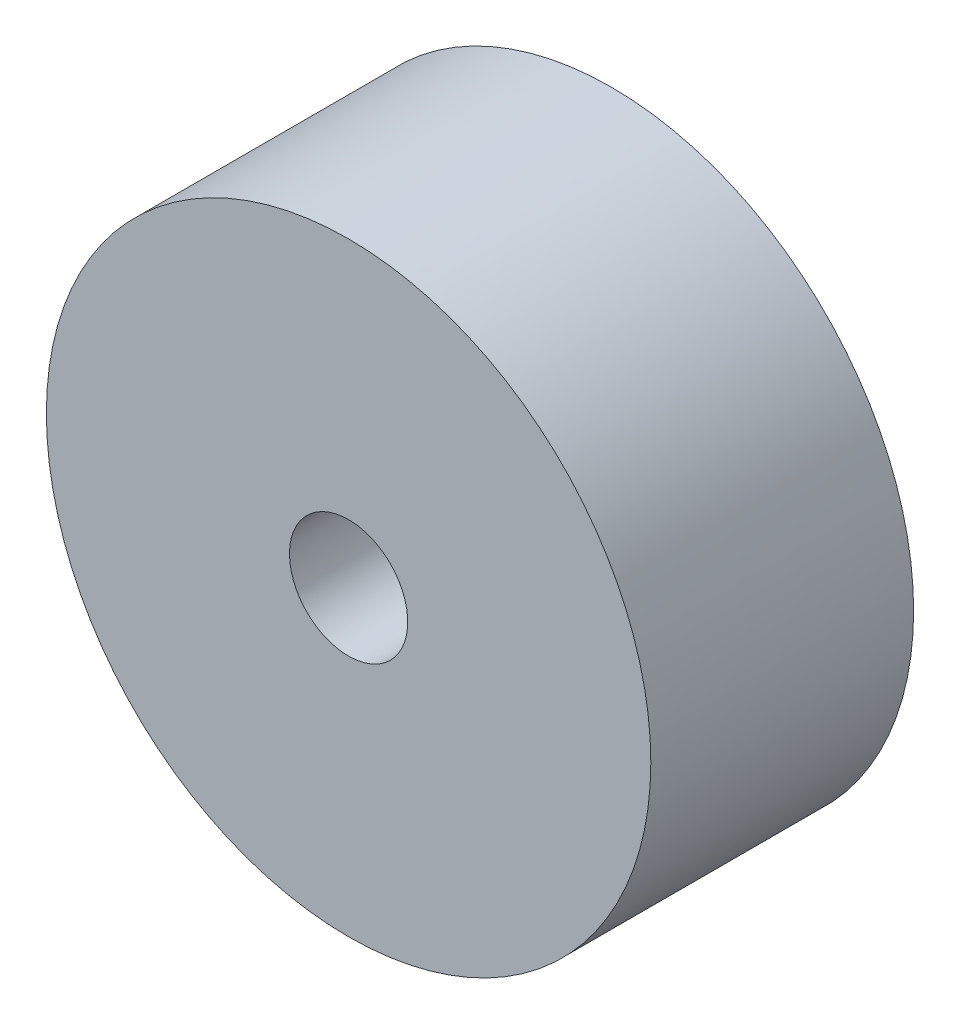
ISO-10303-21;
HEADER;
FILE_DESCRIPTION(('STEP AP214'),'2;1');
FILE_NAME('part.step','',(''),(''),'','','');
FILE_SCHEMA(('AUTOMOTIVE_DESIGN { 1 0 10303 214 1 1 1 1 }'));
ENDSEC;
DATA;
#1=APPLICATION_CONTEXT('core data for automotive mechanical design processes');
#2=APPLICATION_PROTOCOL_DEFINITION('international standard','automotive_design',2000,#1);
#3=PRODUCT_CONTEXT('',#1,'mechanical');
#4=PRODUCT('Part','Part','',(#3));
#5=PRODUCT_RELATED_PRODUCT_CATEGORY('part','',(#4));
#6=PRODUCT_DEFINITION_FORMATION('','',#4);
#7=PRODUCT_DEFINITION_CONTEXT('part definition',#1,'design');
#8=PRODUCT_DEFINITION('design','',#6,#7);
#9=PRODUCT_DEFINITION_SHAPE('','',#8);
#10=(LENGTH_UNIT() NAMED_UNIT(*) SI_UNIT(.MILLI.,.METRE.));
#11=(NAMED_UNIT(*) PLANE_ANGLE_UNIT() SI_UNIT($,.RADIAN.));
#12=(NAMED_UNIT(*) SI_UNIT($,.STERADIAN.) SOLID_ANGLE_UNIT());
#13=UNCERTAINTY_MEASURE_WITH_UNIT(LENGTH_MEASURE(1.E-05),#10,'distance_accuracy_value','');
#14=(GEOMETRIC_REPRESENTATION_CONTEXT(3) GLOBAL_UNCERTAINTY_ASSIGNED_CONTEXT((#13)) GLOBAL_UNIT_ASSIGNED_CONTEXT((#10,
#11,#12)) REPRESENTATION_CONTEXT('',''));
#15=CARTESIAN_POINT('',(0.,0.,0.));
#16=DIRECTION('',(0.,0.,1.));
#17=DIRECTION('',(1.,0.,0.));
#18=AXIS2_PLACEMENT_3D('',#15,#16,#17);
#19=CARTESIAN_POINT('',(0.,0.,10.));
#20=DIRECTION('',(0.,0.,-1.));
#21=DIRECTION('',(-1.,0.,0.));
#22=AXIS2_PLACEMENT_3D('',#19,#20,#21);
#23=CYLINDRICAL_SURFACE('',#22,11.5);
#24=CARTESIAN_POINT('',(0.,0.,10.));
#25=DIRECTION('',(0.,0.,1.));
#26=DIRECTION('',(1.,0.,0.));
#27=AXIS2_PLACEMENT_3D('',#24,#25,#26);
#28=CIRCLE('',#27,11.5);
#29=CARTESIAN_POINT('',(11.5,0.,10.));
#30=VERTEX_POINT('',#29);
#31=EDGE_CURVE('E10',#30,#30,#28,.T.);
#32=ORIENTED_EDGE('',*,*,#31,.F.);
#33=EDGE_LOOP('',(#32));
#34=FACE_BOUND('',#33,.T.);
#35=CARTESIAN_POINT('',(0.,0.,0.));
#36=DIRECTION('',(0.,0.,1.));
#37=DIRECTION('',(1.,0.,0.));
#38=AXIS2_PLACEMENT_3D('',#35,#36,#37);
#39=CIRCLE('',#38,11.5);
#40=CARTESIAN_POINT('',(11.5,0.,0.));
#41=VERTEX_POINT('',#40);
#42=EDGE_CURVE('E40',#41,#41,#39,.T.);
#43=ORIENTED_EDGE('',*,*,#42,.T.);
#44=EDGE_LOOP('',(#43));
#45=FACE_BOUND('',#44,.T.);
#46=ADVANCED_FACE('F37',(#34,#45),#23,.T.);
#47=CARTESIAN_POINT('',(0.,0.,10.));
#48=DIRECTION('',(0.,0.,1.));
#49=DIRECTION('',(1.,0.,0.));
#50=AXIS2_PLACEMENT_3D('',#47,#48,#49);
#51=PLANE('',#50);
#52=CARTESIAN_POINT('',(0.,0.,10.));
#53=DIRECTION('',(0.,0.,-1.));
#54=DIRECTION('',(-1.,0.,0.));
#55=AXIS2_PLACEMENT_3D('',#52,#53,#54);
#56=CIRCLE('',#55,2.25);
#57=CARTESIAN_POINT('',(-2.25,0.,10.));
#58=VERTEX_POINT('',#57);
#59=EDGE_CURVE('E55',#58,#58,#56,.T.);
#60=ORIENTED_EDGE('',*,*,#59,.T.);
#61=EDGE_LOOP('',(#60));
#62=FACE_BOUND('',#61,.T.);
#63=ORIENTED_EDGE('',*,*,#31,.T.);
#64=EDGE_LOOP('',(#63));
#65=FACE_BOUND('',#64,.T.);
#66=ADVANCED_FACE('F67',(#62,#65),#51,.T.);
#67=CARTESIAN_POINT('',(0.,0.,0.));
#68=DIRECTION('',(0.,0.,1.));
#69=DIRECTION('',(1.,0.,0.));
#70=AXIS2_PLACEMENT_3D('',#67,#68,#69);
#71=PLANE('',#70);
#72=CARTESIAN_POINT('',(0.,0.,0.));
#73=DIRECTION('',(0.,0.,-1.));
#74=DIRECTION('',(-1.,0.,0.));
#75=AXIS2_PLACEMENT_3D('',#72,#73,#74);
#76=CIRCLE('',#75,8.5);
#77=CARTESIAN_POINT('',(-8.5,0.,0.));
#78=VERTEX_POINT('',#77);
#79=EDGE_CURVE('E51',#78,#78,#76,.T.);
#80=ORIENTED_EDGE('',*,*,#79,.F.);
#81=EDGE_LOOP('',(#80));
#82=FACE_BOUND('',#81,.T.);
#83=ORIENTED_EDGE('',*,*,#42,.F.);
#84=EDGE_LOOP('',(#83));
#85=FACE_BOUND('',#84,.T.);
#86=ADVANCED_FACE('F84',(#82,#85),#71,.F.);
#87=CARTESIAN_POINT('',(0.,0.,5.));
#88=DIRECTION('',(0.,0.,-1.));
#89=DIRECTION('',(-1.,0.,0.));
#90=AXIS2_PLACEMENT_3D('',#87,#88,#89);
#91=CYLINDRICAL_SURFACE('',#90,8.5);
#92=CARTESIAN_POINT('',(0.,0.,5.));
#93=DIRECTION('',(0.,0.,-1.));
#94=DIRECTION('',(-1.,0.,0.));
#95=AXIS2_PLACEMENT_3D('',#92,#93,#94);
#96=CIRCLE('',#95,8.5);
#97=CARTESIAN_POINT('',(-8.5,0.,5.));
#98=VERTEX_POINT('',#97);
#99=EDGE_CURVE('E49',#98,#98,#96,.T.);
#100=ORIENTED_EDGE('',*,*,#99,.F.);
#101=EDGE_LOOP('',(#100));
#102=FACE_BOUND('',#101,.T.);
#103=ORIENTED_EDGE('',*,*,#79,.T.);
#104=EDGE_LOOP('',(#103));
#105=FACE_BOUND('',#104,.T.);
#106=ADVANCED_FACE('F78',(#102,#105),#91,.F.);
#107=CARTESIAN_POINT('',(0.,0.,5.));
#108=DIRECTION('',(0.,0.,-1.));
#109=DIRECTION('',(-1.,0.,0.));
#110=AXIS2_PLACEMENT_3D('',#107,#108,#109);
#111=PLANE('',#110);
#112=CARTESIAN_POINT('',(0.,0.,5.));
#113=DIRECTION('',(0.,0.,-1.));
#114=DIRECTION('',(-1.,0.,0.));
#115=AXIS2_PLACEMENT_3D('',#112,#113,#114);
#116=CIRCLE('',#115,2.25);
#117=CARTESIAN_POINT('',(-2.25,0.,5.));
#118=VERTEX_POINT('',#117);
#119=EDGE_CURVE('E59',#118,#118,#116,.T.);
#120=ORIENTED_EDGE('',*,*,#119,.F.);
#121=EDGE_LOOP('',(#120));
#122=FACE_BOUND('',#121,.T.);
#123=ORIENTED_EDGE('',*,*,#99,.T.);
#124=EDGE_LOOP('',(#123));
#125=FACE_BOUND('',#124,.T.);
#126=ADVANCED_FACE('F72',(#122,#125),#111,.T.);
#127=CARTESIAN_POINT('',(0.,0.,10.));
#128=DIRECTION('',(0.,0.,-1.));
#129=DIRECTION('',(-1.,0.,0.));
#130=AXIS2_PLACEMENT_3D('',#127,#128,#129);
#131=CYLINDRICAL_SURFACE('',#130,2.25);
#132=ORIENTED_EDGE('',*,*,#59,.F.);
#133=EDGE_LOOP('',(#132));
#134=FACE_BOUND('',#133,.T.);
#135=ORIENTED_EDGE('',*,*,#119,.T.);
#136=EDGE_LOOP('',(#135));
#137=FACE_BOUND('',#136,.T.);
#138=ADVANCED_FACE('F69',(#134,#137),#131,.F.);
#139=CLOSED_SHELL('',(#46,#66,#86,#106,#126,#138));
#140=MANIFOLD_SOLID_BREP('B2',#139);
#141=ADVANCED_BREP_SHAPE_REPRESENTATION('',(#18,#140),#14);
#142=SHAPE_DEFINITION_REPRESENTATION(#9,#141);
ENDSEC;
END-ISO-10303-21;
